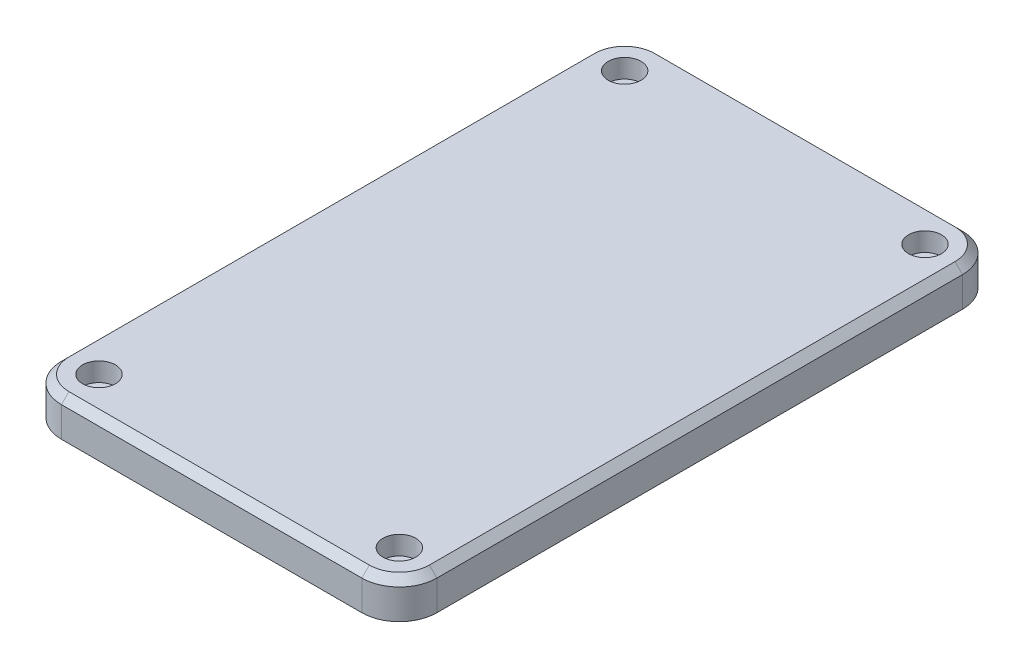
ISO-10303-21;
HEADER;
FILE_DESCRIPTION(('STEP AP214'),'2;1');
FILE_NAME('part.step','',(''),(''),'','','');
FILE_SCHEMA(('AUTOMOTIVE_DESIGN { 1 0 10303 214 1 1 1 1 }'));
ENDSEC;
DATA;
#1=APPLICATION_CONTEXT('core data for automotive mechanical design processes');
#2=APPLICATION_PROTOCOL_DEFINITION('international standard','automotive_design',2000,#1);
#3=PRODUCT_CONTEXT('',#1,'mechanical');
#4=PRODUCT('Part','Part','',(#3));
#5=PRODUCT_RELATED_PRODUCT_CATEGORY('part','',(#4));
#6=PRODUCT_DEFINITION_FORMATION('','',#4);
#7=PRODUCT_DEFINITION_CONTEXT('part definition',#1,'design');
#8=PRODUCT_DEFINITION('design','',#6,#7);
#9=PRODUCT_DEFINITION_SHAPE('','',#8);
#10=(LENGTH_UNIT() NAMED_UNIT(*) SI_UNIT(.MILLI.,.METRE.));
#11=(NAMED_UNIT(*) PLANE_ANGLE_UNIT() SI_UNIT($,.RADIAN.));
#12=(NAMED_UNIT(*) SI_UNIT($,.STERADIAN.) SOLID_ANGLE_UNIT());
#13=UNCERTAINTY_MEASURE_WITH_UNIT(LENGTH_MEASURE(1.E-05),#10,'distance_accuracy_value','');
#14=(GEOMETRIC_REPRESENTATION_CONTEXT(3) GLOBAL_UNCERTAINTY_ASSIGNED_CONTEXT((#13)) GLOBAL_UNIT_ASSIGNED_CONTEXT((#10,
#11,#12)) REPRESENTATION_CONTEXT('',''));
#15=CARTESIAN_POINT('',(0.,0.,0.));
#16=DIRECTION('',(0.,0.,1.));
#17=DIRECTION('',(1.,0.,0.));
#18=AXIS2_PLACEMENT_3D('',#15,#16,#17);
#19=CARTESIAN_POINT('',(0.,0.,203.2));
#20=DIRECTION('',(1.,0.,0.));
#21=DIRECTION('',(0.,0.,-1.));
#22=AXIS2_PLACEMENT_3D('',#19,#20,#21);
#23=PLANE('',#22);
#24=DIRECTION('',(0.,-1.,0.));
#25=VECTOR('',#24,1.);
#26=CARTESIAN_POINT('',(0.,0.,190.5));
#27=LINE('',#26,#25);
#28=CARTESIAN_POINT('',(0.,0.,190.5));
#29=VERTEX_POINT('',#28);
#30=CARTESIAN_POINT('',(0.,10.16,190.5));
#31=VERTEX_POINT('',#30);
#32=EDGE_CURVE('E125',#29,#31,#27,.F.);
#33=ORIENTED_EDGE('',*,*,#32,.T.);
#34=DIRECTION('',(0.,0.,-1.));
#35=VECTOR('',#34,1.);
#36=CARTESIAN_POINT('',(0.,10.16,203.2));
#37=LINE('',#36,#35);
#38=CARTESIAN_POINT('',(0.,10.16,12.7));
#39=VERTEX_POINT('',#38);
#40=EDGE_CURVE('E11',#31,#39,#37,.T.);
#41=ORIENTED_EDGE('',*,*,#40,.T.);
#42=DIRECTION('',(0.,-1.,0.));
#43=VECTOR('',#42,1.);
#44=CARTESIAN_POINT('',(0.,0.,12.7));
#45=LINE('',#44,#43);
#46=CARTESIAN_POINT('',(0.,0.,12.7));
#47=VERTEX_POINT('',#46);
#48=EDGE_CURVE('E123',#39,#47,#45,.T.);
#49=ORIENTED_EDGE('',*,*,#48,.T.);
#50=DIRECTION('',(0.,0.,-1.));
#51=VECTOR('',#50,1.);
#52=CARTESIAN_POINT('',(0.,0.,203.2));
#53=LINE('',#52,#51);
#54=EDGE_CURVE('E119',#29,#47,#53,.T.);
#55=ORIENTED_EDGE('',*,*,#54,.F.);
#56=EDGE_LOOP('',(#33,#41,#49,#55));
#57=FACE_BOUND('',#56,.T.);
#58=ADVANCED_FACE('F27',(#57),#23,.F.);
#59=CARTESIAN_POINT('',(0.,0.,203.2));
#60=DIRECTION('',(0.,1.,0.));
#61=DIRECTION('',(0.,0.,1.));
#62=AXIS2_PLACEMENT_3D('',#59,#60,#61);
#63=PLANE('',#62);
#64=CARTESIAN_POINT('',(12.7,0.,12.7));
#65=DIRECTION('',(0.,1.,0.));
#66=DIRECTION('',(0.,0.,1.));
#67=AXIS2_PLACEMENT_3D('',#64,#65,#66);
#68=CIRCLE('',#67,3.3782);
#69=CARTESIAN_POINT('',(12.7,0.,16.0782));
#70=VERTEX_POINT('',#69);
#71=EDGE_CURVE('E292',#70,#70,#68,.T.);
#72=ORIENTED_EDGE('',*,*,#71,.T.);
#73=EDGE_LOOP('',(#72));
#74=FACE_BOUND('',#73,.T.);
#75=CARTESIAN_POINT('',(114.3,0.,12.7));
#76=DIRECTION('',(0.,1.,0.));
#77=DIRECTION('',(0.,0.,1.));
#78=AXIS2_PLACEMENT_3D('',#75,#76,#77);
#79=CIRCLE('',#78,3.3782);
#80=CARTESIAN_POINT('',(114.3,0.,16.0782));
#81=VERTEX_POINT('',#80);
#82=EDGE_CURVE('E296',#81,#81,#79,.T.);
#83=ORIENTED_EDGE('',*,*,#82,.T.);
#84=EDGE_LOOP('',(#83));
#85=FACE_BOUND('',#84,.T.);
#86=CARTESIAN_POINT('',(114.3,0.,190.5));
#87=DIRECTION('',(0.,1.,0.));
#88=DIRECTION('',(0.,0.,1.));
#89=AXIS2_PLACEMENT_3D('',#86,#87,#88);
#90=CIRCLE('',#89,3.3782);
#91=CARTESIAN_POINT('',(114.3,0.,193.8782));
#92=VERTEX_POINT('',#91);
#93=EDGE_CURVE('E300',#92,#92,#90,.T.);
#94=ORIENTED_EDGE('',*,*,#93,.T.);
#95=EDGE_LOOP('',(#94));
#96=FACE_BOUND('',#95,.T.);
#97=CARTESIAN_POINT('',(12.7,0.,190.5));
#98=DIRECTION('',(0.,1.,0.));
#99=DIRECTION('',(0.,0.,1.));
#100=AXIS2_PLACEMENT_3D('',#97,#98,#99);
#101=CIRCLE('',#100,3.3782);
#102=CARTESIAN_POINT('',(12.7,0.,193.8782));
#103=VERTEX_POINT('',#102);
#104=EDGE_CURVE('E303',#103,#103,#101,.T.);
#105=ORIENTED_EDGE('',*,*,#104,.T.);
#106=EDGE_LOOP('',(#105));
#107=FACE_BOUND('',#106,.T.);
#108=ORIENTED_EDGE('',*,*,#54,.T.);
#109=CARTESIAN_POINT('',(12.7,0.,12.7));
#110=DIRECTION('',(0.,1.,0.));
#111=DIRECTION('',(0.,0.,1.));
#112=AXIS2_PLACEMENT_3D('',#109,#110,#111);
#113=CIRCLE('',#112,12.7);
#114=CARTESIAN_POINT('',(12.7,0.,0.));
#115=VERTEX_POINT('',#114);
#116=EDGE_CURVE('E137',#47,#115,#113,.F.);
#117=ORIENTED_EDGE('',*,*,#116,.T.);
#118=DIRECTION('',(1.,0.,0.));
#119=VECTOR('',#118,1.);
#120=CARTESIAN_POINT('',(0.,0.,0.));
#121=LINE('',#120,#119);
#122=CARTESIAN_POINT('',(114.3,0.,0.));
#123=VERTEX_POINT('',#122);
#124=EDGE_CURVE('E196',#115,#123,#121,.T.);
#125=ORIENTED_EDGE('',*,*,#124,.T.);
#126=CARTESIAN_POINT('',(114.3,0.,12.7));
#127=DIRECTION('',(0.,1.,0.));
#128=DIRECTION('',(0.,0.,1.));
#129=AXIS2_PLACEMENT_3D('',#126,#127,#128);
#130=CIRCLE('',#129,12.7);
#131=CARTESIAN_POINT('',(127.,0.,12.7));
#132=VERTEX_POINT('',#131);
#133=EDGE_CURVE('E135',#123,#132,#130,.F.);
#134=ORIENTED_EDGE('',*,*,#133,.T.);
#135=DIRECTION('',(0.,0.,-1.));
#136=VECTOR('',#135,1.);
#137=CARTESIAN_POINT('',(127.,0.,203.2));
#138=LINE('',#137,#136);
#139=CARTESIAN_POINT('',(127.,0.,190.5));
#140=VERTEX_POINT('',#139);
#141=EDGE_CURVE('E127',#140,#132,#138,.T.);
#142=ORIENTED_EDGE('',*,*,#141,.F.);
#143=CARTESIAN_POINT('',(114.3,0.,190.5));
#144=DIRECTION('',(0.,1.,0.));
#145=DIRECTION('',(0.,0.,1.));
#146=AXIS2_PLACEMENT_3D('',#143,#144,#145);
#147=CIRCLE('',#146,12.7);
#148=CARTESIAN_POINT('',(114.3,0.,203.2));
#149=VERTEX_POINT('',#148);
#150=EDGE_CURVE('E122',#140,#149,#147,.F.);
#151=ORIENTED_EDGE('',*,*,#150,.T.);
#152=DIRECTION('',(1.,0.,0.));
#153=VECTOR('',#152,1.);
#154=CARTESIAN_POINT('',(0.,0.,203.2));
#155=LINE('',#154,#153);
#156=CARTESIAN_POINT('',(12.7,0.,203.2));
#157=VERTEX_POINT('',#156);
#158=EDGE_CURVE('E121',#157,#149,#155,.T.);
#159=ORIENTED_EDGE('',*,*,#158,.F.);
#160=CARTESIAN_POINT('',(12.7,0.,190.5));
#161=DIRECTION('',(0.,1.,0.));
#162=DIRECTION('',(0.,0.,1.));
#163=AXIS2_PLACEMENT_3D('',#160,#161,#162);
#164=CIRCLE('',#163,12.7);
#165=EDGE_CURVE('E116',#157,#29,#164,.F.);
#166=ORIENTED_EDGE('',*,*,#165,.T.);
#167=EDGE_LOOP('',(#108,#117,#125,#134,#142,#151,#159,#166));
#168=FACE_BOUND('',#167,.T.);
#169=ADVANCED_FACE('F118',(#74,#85,#96,#107,#168),#63,.F.);
#170=CARTESIAN_POINT('',(127.,0.,203.2));
#171=DIRECTION('',(-1.,0.,0.));
#172=DIRECTION('',(0.,0.,1.));
#173=AXIS2_PLACEMENT_3D('',#170,#171,#172);
#174=PLANE('',#173);
#175=DIRECTION('',(0.,1.,0.));
#176=VECTOR('',#175,1.);
#177=CARTESIAN_POINT('',(127.,12.7,12.7));
#178=LINE('',#177,#176);
#179=CARTESIAN_POINT('',(127.,10.16,12.7));
#180=VERTEX_POINT('',#179);
#181=EDGE_CURVE('E146',#132,#180,#178,.T.);
#182=ORIENTED_EDGE('',*,*,#181,.T.);
#183=DIRECTION('',(0.,0.,1.));
#184=VECTOR('',#183,1.);
#185=CARTESIAN_POINT('',(127.,10.16,203.2));
#186=LINE('',#185,#184);
#187=CARTESIAN_POINT('',(127.,10.16,190.5));
#188=VERTEX_POINT('',#187);
#189=EDGE_CURVE('E171',#180,#188,#186,.T.);
#190=ORIENTED_EDGE('',*,*,#189,.T.);
#191=DIRECTION('',(0.,1.,0.));
#192=VECTOR('',#191,1.);
#193=CARTESIAN_POINT('',(127.,0.,190.5));
#194=LINE('',#193,#192);
#195=EDGE_CURVE('E144',#188,#140,#194,.F.);
#196=ORIENTED_EDGE('',*,*,#195,.T.);
#197=ORIENTED_EDGE('',*,*,#141,.T.);
#198=EDGE_LOOP('',(#182,#190,#196,#197));
#199=FACE_BOUND('',#198,.T.);
#200=ADVANCED_FACE('F225',(#199),#174,.F.);
#201=CARTESIAN_POINT('',(0.,12.7,203.2));
#202=DIRECTION('',(0.,-1.,0.));
#203=DIRECTION('',(0.,0.,-1.));
#204=AXIS2_PLACEMENT_3D('',#201,#202,#203);
#205=PLANE('',#204);
#206=CARTESIAN_POINT('',(12.7,12.7,12.7));
#207=DIRECTION('',(0.,1.,0.));
#208=DIRECTION('',(0.,0.,1.));
#209=AXIS2_PLACEMENT_3D('',#206,#207,#208);
#210=CIRCLE('',#209,5.55625);
#211=CARTESIAN_POINT('',(12.7,12.7,18.25625));
#212=VERTEX_POINT('',#211);
#213=EDGE_CURVE('E344',#212,#212,#210,.T.);
#214=ORIENTED_EDGE('',*,*,#213,.F.);
#215=EDGE_LOOP('',(#214));
#216=FACE_BOUND('',#215,.T.);
#217=CARTESIAN_POINT('',(114.3,12.7,12.7));
#218=DIRECTION('',(0.,1.,0.));
#219=DIRECTION('',(0.,0.,1.));
#220=AXIS2_PLACEMENT_3D('',#217,#218,#219);
#221=CIRCLE('',#220,5.55625);
#222=CARTESIAN_POINT('',(114.3,12.7,18.25625));
#223=VERTEX_POINT('',#222);
#224=EDGE_CURVE('E334',#223,#223,#221,.T.);
#225=ORIENTED_EDGE('',*,*,#224,.F.);
#226=EDGE_LOOP('',(#225));
#227=FACE_BOUND('',#226,.T.);
#228=CARTESIAN_POINT('',(114.3,12.7,190.5));
#229=DIRECTION('',(0.,1.,0.));
#230=DIRECTION('',(0.,0.,1.));
#231=AXIS2_PLACEMENT_3D('',#228,#229,#230);
#232=CIRCLE('',#231,5.55625);
#233=CARTESIAN_POINT('',(114.3,12.7,196.05625));
#234=VERTEX_POINT('',#233);
#235=EDGE_CURVE('E324',#234,#234,#232,.T.);
#236=ORIENTED_EDGE('',*,*,#235,.F.);
#237=EDGE_LOOP('',(#236));
#238=FACE_BOUND('',#237,.T.);
#239=CARTESIAN_POINT('',(12.7,12.7,190.5));
#240=DIRECTION('',(0.,1.,0.));
#241=DIRECTION('',(0.,0.,1.));
#242=AXIS2_PLACEMENT_3D('',#239,#240,#241);
#243=CIRCLE('',#242,5.55625);
#244=CARTESIAN_POINT('',(12.7,12.7,196.05625));
#245=VERTEX_POINT('',#244);
#246=EDGE_CURVE('E314',#245,#245,#243,.T.);
#247=ORIENTED_EDGE('',*,*,#246,.F.);
#248=EDGE_LOOP('',(#247));
#249=FACE_BOUND('',#248,.T.);
#250=CARTESIAN_POINT('',(114.3,12.7,190.5));
#251=DIRECTION('',(0.,-1.,0.));
#252=DIRECTION('',(0.,0.,-1.));
#253=AXIS2_PLACEMENT_3D('',#250,#251,#252);
#254=CIRCLE('',#253,10.16);
#255=CARTESIAN_POINT('',(114.3,12.7,200.66));
#256=VERTEX_POINT('',#255);
#257=CARTESIAN_POINT('',(124.46,12.7,190.5));
#258=VERTEX_POINT('',#257);
#259=EDGE_CURVE('E166',#256,#258,#254,.F.);
#260=ORIENTED_EDGE('',*,*,#259,.T.);
#261=DIRECTION('',(0.,0.,-1.));
#262=VECTOR('',#261,1.);
#263=CARTESIAN_POINT('',(124.46,12.7,203.2));
#264=LINE('',#263,#262);
#265=CARTESIAN_POINT('',(124.46,12.7,12.7));
#266=VERTEX_POINT('',#265);
#267=EDGE_CURVE('E168',#258,#266,#264,.T.);
#268=ORIENTED_EDGE('',*,*,#267,.T.);
#269=CARTESIAN_POINT('',(114.3,12.7,12.7));
#270=DIRECTION('',(0.,-1.,0.));
#271=DIRECTION('',(0.,0.,-1.));
#272=AXIS2_PLACEMENT_3D('',#269,#270,#271);
#273=CIRCLE('',#272,10.16);
#274=CARTESIAN_POINT('',(114.3,12.7,2.53999999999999));
#275=VERTEX_POINT('',#274);
#276=EDGE_CURVE('E164',#266,#275,#273,.F.);
#277=ORIENTED_EDGE('',*,*,#276,.T.);
#278=DIRECTION('',(-1.,0.,0.));
#279=VECTOR('',#278,1.);
#280=CARTESIAN_POINT('',(12.7,12.7,2.53999999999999));
#281=LINE('',#280,#279);
#282=CARTESIAN_POINT('',(12.7,12.7,2.53999999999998));
#283=VERTEX_POINT('',#282);
#284=EDGE_CURVE('E160',#275,#283,#281,.T.);
#285=ORIENTED_EDGE('',*,*,#284,.T.);
#286=CARTESIAN_POINT('',(12.7,12.7,12.7));
#287=DIRECTION('',(0.,-1.,0.));
#288=DIRECTION('',(0.,0.,-1.));
#289=AXIS2_PLACEMENT_3D('',#286,#287,#288);
#290=CIRCLE('',#289,10.16);
#291=CARTESIAN_POINT('',(2.53999999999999,12.7,12.7));
#292=VERTEX_POINT('',#291);
#293=EDGE_CURVE('E156',#283,#292,#290,.F.);
#294=ORIENTED_EDGE('',*,*,#293,.T.);
#295=DIRECTION('',(0.,0.,1.));
#296=VECTOR('',#295,1.);
#297=CARTESIAN_POINT('',(2.53999999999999,12.7,203.2));
#298=LINE('',#297,#296);
#299=CARTESIAN_POINT('',(2.53999999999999,12.7,190.5));
#300=VERTEX_POINT('',#299);
#301=EDGE_CURVE('E154',#292,#300,#298,.T.);
#302=ORIENTED_EDGE('',*,*,#301,.T.);
#303=CARTESIAN_POINT('',(12.7,12.7,190.5));
#304=DIRECTION('',(0.,-1.,0.));
#305=DIRECTION('',(0.,0.,-1.));
#306=AXIS2_PLACEMENT_3D('',#303,#304,#305);
#307=CIRCLE('',#306,10.16);
#308=CARTESIAN_POINT('',(12.7,12.7,200.66));
#309=VERTEX_POINT('',#308);
#310=EDGE_CURVE('E158',#300,#309,#307,.F.);
#311=ORIENTED_EDGE('',*,*,#310,.T.);
#312=DIRECTION('',(1.,0.,0.));
#313=VECTOR('',#312,1.);
#314=CARTESIAN_POINT('',(0.,12.7,200.66));
#315=LINE('',#314,#313);
#316=EDGE_CURVE('E162',#309,#256,#315,.T.);
#317=ORIENTED_EDGE('',*,*,#316,.T.);
#318=EDGE_LOOP('',(#260,#268,#277,#285,#294,#302,#311,#317));
#319=FACE_BOUND('',#318,.T.);
#320=ADVANCED_FACE('F268',(#216,#227,#238,#249,#319),#205,.F.);
#321=CARTESIAN_POINT('',(0.,12.7,203.2));
#322=DIRECTION('',(0.,0.,-1.));
#323=DIRECTION('',(-1.,0.,0.));
#324=AXIS2_PLACEMENT_3D('',#321,#322,#323);
#325=PLANE('',#324);
#326=DIRECTION('',(0.,1.,0.));
#327=VECTOR('',#326,1.);
#328=CARTESIAN_POINT('',(114.3,12.7,203.2));
#329=LINE('',#328,#327);
#330=CARTESIAN_POINT('',(114.3,10.16,203.2));
#331=VERTEX_POINT('',#330);
#332=EDGE_CURVE('E151',#149,#331,#329,.T.);
#333=ORIENTED_EDGE('',*,*,#332,.T.);
#334=DIRECTION('',(-1.,0.,0.));
#335=VECTOR('',#334,1.);
#336=CARTESIAN_POINT('',(0.,10.16,203.2));
#337=LINE('',#336,#335);
#338=CARTESIAN_POINT('',(12.7,10.16,203.2));
#339=VERTEX_POINT('',#338);
#340=EDGE_CURVE('E178',#331,#339,#337,.T.);
#341=ORIENTED_EDGE('',*,*,#340,.T.);
#342=DIRECTION('',(0.,-1.,0.));
#343=VECTOR('',#342,1.);
#344=CARTESIAN_POINT('',(12.7,12.7,203.2));
#345=LINE('',#344,#343);
#346=EDGE_CURVE('E149',#339,#157,#345,.T.);
#347=ORIENTED_EDGE('',*,*,#346,.T.);
#348=ORIENTED_EDGE('',*,*,#158,.T.);
#349=EDGE_LOOP('',(#333,#341,#347,#348));
#350=FACE_BOUND('',#349,.T.);
#351=ADVANCED_FACE('F245',(#350),#325,.F.);
#352=CARTESIAN_POINT('',(0.,12.7,0.));
#353=DIRECTION('',(0.,0.,-1.));
#354=DIRECTION('',(-1.,0.,0.));
#355=AXIS2_PLACEMENT_3D('',#352,#353,#354);
#356=PLANE('',#355);
#357=DIRECTION('',(0.,-1.,0.));
#358=VECTOR('',#357,1.);
#359=CARTESIAN_POINT('',(12.7,12.7,0.));
#360=LINE('',#359,#358);
#361=CARTESIAN_POINT('',(12.7,10.16,0.));
#362=VERTEX_POINT('',#361);
#363=EDGE_CURVE('E141',#115,#362,#360,.F.);
#364=ORIENTED_EDGE('',*,*,#363,.T.);
#365=DIRECTION('',(1.,0.,0.));
#366=VECTOR('',#365,1.);
#367=CARTESIAN_POINT('',(114.3,10.16,0.));
#368=LINE('',#367,#366);
#369=CARTESIAN_POINT('',(114.3,10.16,0.));
#370=VERTEX_POINT('',#369);
#371=EDGE_CURVE('E180',#362,#370,#368,.T.);
#372=ORIENTED_EDGE('',*,*,#371,.T.);
#373=DIRECTION('',(0.,1.,0.));
#374=VECTOR('',#373,1.);
#375=CARTESIAN_POINT('',(114.3,0.,0.));
#376=LINE('',#375,#374);
#377=EDGE_CURVE('E139',#370,#123,#376,.F.);
#378=ORIENTED_EDGE('',*,*,#377,.T.);
#379=ORIENTED_EDGE('',*,*,#124,.F.);
#380=EDGE_LOOP('',(#364,#372,#378,#379));
#381=FACE_BOUND('',#380,.T.);
#382=ADVANCED_FACE('F192',(#381),#356,.T.);
#383=CARTESIAN_POINT('',(12.7,0.,12.7));
#384=DIRECTION('',(0.,1.,0.));
#385=DIRECTION('',(0.,0.,1.));
#386=AXIS2_PLACEMENT_3D('',#383,#384,#385);
#387=CYLINDRICAL_SURFACE('',#386,12.7);
#388=ORIENTED_EDGE('',*,*,#48,.F.);
#389=CARTESIAN_POINT('',(12.7,10.16,12.7));
#390=DIRECTION('',(0.,-1.,0.));
#391=DIRECTION('',(0.,0.,-1.));
#392=AXIS2_PLACEMENT_3D('',#389,#390,#391);
#393=CIRCLE('',#392,12.7);
#394=EDGE_CURVE('E34',#39,#362,#393,.T.);
#395=ORIENTED_EDGE('',*,*,#394,.T.);
#396=ORIENTED_EDGE('',*,*,#363,.F.);
#397=ORIENTED_EDGE('',*,*,#116,.F.);
#398=EDGE_LOOP('',(#388,#395,#396,#397));
#399=FACE_BOUND('',#398,.T.);
#400=ADVANCED_FACE('F185',(#399),#387,.T.);
#401=CARTESIAN_POINT('',(114.3,0.,12.7));
#402=DIRECTION('',(0.,-1.,0.));
#403=DIRECTION('',(0.,0.,-1.));
#404=AXIS2_PLACEMENT_3D('',#401,#402,#403);
#405=CYLINDRICAL_SURFACE('',#404,12.7);
#406=ORIENTED_EDGE('',*,*,#377,.F.);
#407=CARTESIAN_POINT('',(114.3,10.16,12.7));
#408=DIRECTION('',(0.,-1.,0.));
#409=DIRECTION('',(0.,0.,-1.));
#410=AXIS2_PLACEMENT_3D('',#407,#408,#409);
#411=CIRCLE('',#410,12.7);
#412=EDGE_CURVE('E176',#370,#180,#411,.T.);
#413=ORIENTED_EDGE('',*,*,#412,.T.);
#414=ORIENTED_EDGE('',*,*,#181,.F.);
#415=ORIENTED_EDGE('',*,*,#133,.F.);
#416=EDGE_LOOP('',(#406,#413,#414,#415));
#417=FACE_BOUND('',#416,.T.);
#418=ADVANCED_FACE('F220',(#417),#405,.T.);
#419=CARTESIAN_POINT('',(114.3,12.7,190.5));
#420=DIRECTION('',(0.,1.,0.));
#421=DIRECTION('',(0.,0.,1.));
#422=AXIS2_PLACEMENT_3D('',#419,#420,#421);
#423=CYLINDRICAL_SURFACE('',#422,12.7);
#424=ORIENTED_EDGE('',*,*,#195,.F.);
#425=CARTESIAN_POINT('',(114.3,10.16,190.5));
#426=DIRECTION('',(0.,-1.,0.));
#427=DIRECTION('',(0.,0.,-1.));
#428=AXIS2_PLACEMENT_3D('',#425,#426,#427);
#429=CIRCLE('',#428,12.7);
#430=EDGE_CURVE('E174',#188,#331,#429,.T.);
#431=ORIENTED_EDGE('',*,*,#430,.T.);
#432=ORIENTED_EDGE('',*,*,#332,.F.);
#433=ORIENTED_EDGE('',*,*,#150,.F.);
#434=EDGE_LOOP('',(#424,#431,#432,#433));
#435=FACE_BOUND('',#434,.T.);
#436=ADVANCED_FACE('F241',(#435),#423,.T.);
#437=CARTESIAN_POINT('',(12.7,12.7,190.5));
#438=DIRECTION('',(0.,-1.,0.));
#439=DIRECTION('',(0.,0.,-1.));
#440=AXIS2_PLACEMENT_3D('',#437,#438,#439);
#441=CYLINDRICAL_SURFACE('',#440,12.7);
#442=ORIENTED_EDGE('',*,*,#346,.F.);
#443=CARTESIAN_POINT('',(12.7,10.16,190.5));
#444=DIRECTION('',(0.,-1.,0.));
#445=DIRECTION('',(0.,0.,-1.));
#446=AXIS2_PLACEMENT_3D('',#443,#444,#445);
#447=CIRCLE('',#446,12.7);
#448=EDGE_CURVE('E47',#339,#31,#447,.T.);
#449=ORIENTED_EDGE('',*,*,#448,.T.);
#450=ORIENTED_EDGE('',*,*,#32,.F.);
#451=ORIENTED_EDGE('',*,*,#165,.F.);
#452=EDGE_LOOP('',(#442,#449,#450,#451));
#453=FACE_BOUND('',#452,.T.);
#454=ADVANCED_FACE('F129',(#453),#441,.T.);
#455=CARTESIAN_POINT('',(0.,10.16,203.2));
#456=DIRECTION('',(0.707106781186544,-0.707106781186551,0.));
#457=DIRECTION('',(0.707106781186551,0.707106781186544,0.));
#458=AXIS2_PLACEMENT_3D('',#455,#456,#457);
#459=PLANE('',#458);
#460=DIRECTION('',(0.707106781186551,0.707106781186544,0.));
#461=VECTOR('',#460,1.);
#462=CARTESIAN_POINT('',(0.,10.16,12.7));
#463=LINE('',#462,#461);
#464=EDGE_CURVE('E253',#39,#292,#463,.T.);
#465=ORIENTED_EDGE('',*,*,#464,.F.);
#466=ORIENTED_EDGE('',*,*,#40,.F.);
#467=DIRECTION('',(-0.707106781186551,-0.707106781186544,0.));
#468=VECTOR('',#467,1.);
#469=CARTESIAN_POINT('',(2.53999999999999,12.7,190.5));
#470=LINE('',#469,#468);
#471=EDGE_CURVE('E255',#300,#31,#470,.T.);
#472=ORIENTED_EDGE('',*,*,#471,.F.);
#473=ORIENTED_EDGE('',*,*,#301,.F.);
#474=EDGE_LOOP('',(#465,#466,#472,#473));
#475=FACE_BOUND('',#474,.T.);
#476=ADVANCED_FACE('F266',(#475),#459,.F.);
#477=CARTESIAN_POINT('',(12.7,12.7,190.5));
#478=DIRECTION('',(0.,-1.,0.));
#479=DIRECTION('',(0.,0.,-1.));
#480=AXIS2_PLACEMENT_3D('',#477,#478,#479);
#481=CONICAL_SURFACE('',#480,10.16,0.785398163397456);
#482=ORIENTED_EDGE('',*,*,#471,.T.);
#483=ORIENTED_EDGE('',*,*,#448,.F.);
#484=DIRECTION('',(0.,-0.707106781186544,0.707106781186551));
#485=VECTOR('',#484,1.);
#486=CARTESIAN_POINT('',(12.7,12.7,200.66));
#487=LINE('',#486,#485);
#488=EDGE_CURVE('E203',#309,#339,#487,.T.);
#489=ORIENTED_EDGE('',*,*,#488,.F.);
#490=ORIENTED_EDGE('',*,*,#310,.F.);
#491=EDGE_LOOP('',(#482,#483,#489,#490));
#492=FACE_BOUND('',#491,.T.);
#493=ADVANCED_FACE('F263',(#492),#481,.T.);
#494=CARTESIAN_POINT('',(12.7,12.7,12.7));
#495=DIRECTION('',(0.,-1.,0.));
#496=DIRECTION('',(0.,0.,-1.));
#497=AXIS2_PLACEMENT_3D('',#494,#495,#496);
#498=CONICAL_SURFACE('',#497,10.16,0.785398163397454);
#499=ORIENTED_EDGE('',*,*,#464,.T.);
#500=ORIENTED_EDGE('',*,*,#293,.F.);
#501=DIRECTION('',(0.,0.707106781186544,0.707106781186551));
#502=VECTOR('',#501,1.);
#503=CARTESIAN_POINT('',(12.7,10.16,0.));
#504=LINE('',#503,#502);
#505=EDGE_CURVE('E199',#362,#283,#504,.T.);
#506=ORIENTED_EDGE('',*,*,#505,.F.);
#507=ORIENTED_EDGE('',*,*,#394,.F.);
#508=EDGE_LOOP('',(#499,#500,#506,#507));
#509=FACE_BOUND('',#508,.T.);
#510=ADVANCED_FACE('F200',(#509),#498,.T.);
#511=CARTESIAN_POINT('',(0.,10.16,203.2));
#512=DIRECTION('',(0.,-0.707106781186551,-0.707106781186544));
#513=DIRECTION('',(0.,0.707106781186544,-0.707106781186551));
#514=AXIS2_PLACEMENT_3D('',#511,#512,#513);
#515=PLANE('',#514);
#516=ORIENTED_EDGE('',*,*,#488,.T.);
#517=ORIENTED_EDGE('',*,*,#340,.F.);
#518=DIRECTION('',(0.,-0.707106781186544,0.707106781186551));
#519=VECTOR('',#518,1.);
#520=CARTESIAN_POINT('',(114.3,12.7,200.66));
#521=LINE('',#520,#519);
#522=EDGE_CURVE('E204',#256,#331,#521,.T.);
#523=ORIENTED_EDGE('',*,*,#522,.F.);
#524=ORIENTED_EDGE('',*,*,#316,.F.);
#525=EDGE_LOOP('',(#516,#517,#523,#524));
#526=FACE_BOUND('',#525,.T.);
#527=ADVANCED_FACE('F248',(#526),#515,.F.);
#528=CARTESIAN_POINT('',(0.,12.7,2.53999999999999));
#529=DIRECTION('',(0.,0.707106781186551,-0.707106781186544));
#530=DIRECTION('',(0.,0.707106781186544,0.707106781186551));
#531=AXIS2_PLACEMENT_3D('',#528,#529,#530);
#532=PLANE('',#531);
#533=ORIENTED_EDGE('',*,*,#505,.T.);
#534=ORIENTED_EDGE('',*,*,#284,.F.);
#535=DIRECTION('',(0.,0.707106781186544,0.707106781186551));
#536=VECTOR('',#535,1.);
#537=CARTESIAN_POINT('',(114.3,10.16,0.));
#538=LINE('',#537,#536);
#539=EDGE_CURVE('E209',#370,#275,#538,.T.);
#540=ORIENTED_EDGE('',*,*,#539,.F.);
#541=ORIENTED_EDGE('',*,*,#371,.F.);
#542=EDGE_LOOP('',(#533,#534,#540,#541));
#543=FACE_BOUND('',#542,.T.);
#544=ADVANCED_FACE('F207',(#543),#532,.T.);
#545=CARTESIAN_POINT('',(114.3,12.7,190.5));
#546=DIRECTION('',(0.,-1.,0.));
#547=DIRECTION('',(0.,0.,-1.));
#548=AXIS2_PLACEMENT_3D('',#545,#546,#547);
#549=CONICAL_SURFACE('',#548,10.16,0.785398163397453);
#550=ORIENTED_EDGE('',*,*,#522,.T.);
#551=ORIENTED_EDGE('',*,*,#430,.F.);
#552=DIRECTION('',(0.707106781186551,-0.707106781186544,0.));
#553=VECTOR('',#552,1.);
#554=CARTESIAN_POINT('',(124.46,12.7,190.5));
#555=LINE('',#554,#553);
#556=EDGE_CURVE('E213',#258,#188,#555,.T.);
#557=ORIENTED_EDGE('',*,*,#556,.F.);
#558=ORIENTED_EDGE('',*,*,#259,.F.);
#559=EDGE_LOOP('',(#550,#551,#557,#558));
#560=FACE_BOUND('',#559,.T.);
#561=ADVANCED_FACE('F237',(#560),#549,.T.);
#562=CARTESIAN_POINT('',(114.3,12.7,12.7));
#563=DIRECTION('',(0.,-1.,0.));
#564=DIRECTION('',(0.,0.,-1.));
#565=AXIS2_PLACEMENT_3D('',#562,#563,#564);
#566=CONICAL_SURFACE('',#565,10.16,0.785398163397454);
#567=ORIENTED_EDGE('',*,*,#539,.T.);
#568=ORIENTED_EDGE('',*,*,#276,.F.);
#569=DIRECTION('',(-0.707106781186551,0.707106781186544,0.));
#570=VECTOR('',#569,1.);
#571=CARTESIAN_POINT('',(127.,10.16,12.7));
#572=LINE('',#571,#570);
#573=EDGE_CURVE('E217',#180,#266,#572,.T.);
#574=ORIENTED_EDGE('',*,*,#573,.F.);
#575=ORIENTED_EDGE('',*,*,#412,.F.);
#576=EDGE_LOOP('',(#567,#568,#574,#575));
#577=FACE_BOUND('',#576,.T.);
#578=ADVANCED_FACE('F216',(#577),#566,.T.);
#579=CARTESIAN_POINT('',(124.46,12.7,203.2));
#580=DIRECTION('',(-0.707106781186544,-0.707106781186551,0.));
#581=DIRECTION('',(0.707106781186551,-0.707106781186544,0.));
#582=AXIS2_PLACEMENT_3D('',#579,#580,#581);
#583=PLANE('',#582);
#584=ORIENTED_EDGE('',*,*,#556,.T.);
#585=ORIENTED_EDGE('',*,*,#189,.F.);
#586=ORIENTED_EDGE('',*,*,#573,.T.);
#587=ORIENTED_EDGE('',*,*,#267,.F.);
#588=EDGE_LOOP('',(#584,#585,#586,#587));
#589=FACE_BOUND('',#588,.T.);
#590=ADVANCED_FACE('F229',(#589),#583,.F.);
#591=CARTESIAN_POINT('',(12.7,12.7,190.5));
#592=DIRECTION('',(0.,1.,0.));
#593=DIRECTION('',(0.,0.,1.));
#594=AXIS2_PLACEMENT_3D('',#591,#592,#593);
#595=CYLINDRICAL_SURFACE('',#594,3.3782);
#596=ORIENTED_EDGE('',*,*,#104,.F.);
#597=EDGE_LOOP('',(#596));
#598=FACE_BOUND('',#597,.T.);
#599=CARTESIAN_POINT('',(12.7,6.35,190.5));
#600=DIRECTION('',(0.,1.,0.));
#601=DIRECTION('',(0.,0.,1.));
#602=AXIS2_PLACEMENT_3D('',#599,#600,#601);
#603=CIRCLE('',#602,3.3782);
#604=CARTESIAN_POINT('',(12.7,6.35,193.8782));
#605=VERTEX_POINT('',#604);
#606=EDGE_CURVE('E305',#605,#605,#603,.T.);
#607=ORIENTED_EDGE('',*,*,#606,.T.);
#608=EDGE_LOOP('',(#607));
#609=FACE_BOUND('',#608,.T.);
#610=ADVANCED_FACE('F394',(#598,#609),#595,.F.);
#611=CARTESIAN_POINT('',(16.0782,6.35,190.5));
#612=DIRECTION('',(0.,-1.,0.));
#613=DIRECTION('',(0.,0.,-1.));
#614=AXIS2_PLACEMENT_3D('',#611,#612,#613);
#615=PLANE('',#614);
#616=ORIENTED_EDGE('',*,*,#606,.F.);
#617=EDGE_LOOP('',(#616));
#618=FACE_BOUND('',#617,.T.);
#619=CARTESIAN_POINT('',(12.7,6.35,190.5));
#620=DIRECTION('',(0.,1.,0.));
#621=DIRECTION('',(0.,0.,1.));
#622=AXIS2_PLACEMENT_3D('',#619,#620,#621);
#623=CIRCLE('',#622,5.55625);
#624=CARTESIAN_POINT('',(12.7,6.35,196.05625));
#625=VERTEX_POINT('',#624);
#626=EDGE_CURVE('E309',#625,#625,#623,.T.);
#627=ORIENTED_EDGE('',*,*,#626,.T.);
#628=EDGE_LOOP('',(#627));
#629=FACE_BOUND('',#628,.T.);
#630=ADVANCED_FACE('F390',(#618,#629),#615,.F.);
#631=CARTESIAN_POINT('',(12.7,12.7,190.5));
#632=DIRECTION('',(0.,1.,0.));
#633=DIRECTION('',(0.,0.,1.));
#634=AXIS2_PLACEMENT_3D('',#631,#632,#633);
#635=CYLINDRICAL_SURFACE('',#634,5.55625);
#636=ORIENTED_EDGE('',*,*,#626,.F.);
#637=EDGE_LOOP('',(#636));
#638=FACE_BOUND('',#637,.T.);
#639=ORIENTED_EDGE('',*,*,#246,.T.);
#640=EDGE_LOOP('',(#639));
#641=FACE_BOUND('',#640,.T.);
#642=ADVANCED_FACE('F386',(#638,#641),#635,.F.);
#643=CARTESIAN_POINT('',(114.3,12.7,190.5));
#644=DIRECTION('',(0.,1.,0.));
#645=DIRECTION('',(0.,0.,1.));
#646=AXIS2_PLACEMENT_3D('',#643,#644,#645);
#647=CYLINDRICAL_SURFACE('',#646,3.3782);
#648=ORIENTED_EDGE('',*,*,#93,.F.);
#649=EDGE_LOOP('',(#648));
#650=FACE_BOUND('',#649,.T.);
#651=CARTESIAN_POINT('',(114.3,6.35,190.5));
#652=DIRECTION('',(0.,1.,0.));
#653=DIRECTION('',(0.,0.,1.));
#654=AXIS2_PLACEMENT_3D('',#651,#652,#653);
#655=CIRCLE('',#654,3.3782);
#656=CARTESIAN_POINT('',(114.3,6.35,193.8782));
#657=VERTEX_POINT('',#656);
#658=EDGE_CURVE('E318',#657,#657,#655,.T.);
#659=ORIENTED_EDGE('',*,*,#658,.T.);
#660=EDGE_LOOP('',(#659));
#661=FACE_BOUND('',#660,.T.);
#662=ADVANCED_FACE('F382',(#650,#661),#647,.F.);
#663=CARTESIAN_POINT('',(117.6782,6.35,190.5));
#664=DIRECTION('',(0.,-1.,0.));
#665=DIRECTION('',(0.,0.,-1.));
#666=AXIS2_PLACEMENT_3D('',#663,#664,#665);
#667=PLANE('',#666);
#668=ORIENTED_EDGE('',*,*,#658,.F.);
#669=EDGE_LOOP('',(#668));
#670=FACE_BOUND('',#669,.T.);
#671=CARTESIAN_POINT('',(114.3,6.35,190.5));
#672=DIRECTION('',(0.,1.,0.));
#673=DIRECTION('',(0.,0.,1.));
#674=AXIS2_PLACEMENT_3D('',#671,#672,#673);
#675=CIRCLE('',#674,5.55625);
#676=CARTESIAN_POINT('',(114.3,6.35,196.05625));
#677=VERTEX_POINT('',#676);
#678=EDGE_CURVE('E321',#677,#677,#675,.T.);
#679=ORIENTED_EDGE('',*,*,#678,.T.);
#680=EDGE_LOOP('',(#679));
#681=FACE_BOUND('',#680,.T.);
#682=ADVANCED_FACE('F378',(#670,#681),#667,.F.);
#683=CARTESIAN_POINT('',(114.3,12.7,190.5));
#684=DIRECTION('',(0.,1.,0.));
#685=DIRECTION('',(0.,0.,1.));
#686=AXIS2_PLACEMENT_3D('',#683,#684,#685);
#687=CYLINDRICAL_SURFACE('',#686,5.55625);
#688=ORIENTED_EDGE('',*,*,#678,.F.);
#689=EDGE_LOOP('',(#688));
#690=FACE_BOUND('',#689,.T.);
#691=ORIENTED_EDGE('',*,*,#235,.T.);
#692=EDGE_LOOP('',(#691));
#693=FACE_BOUND('',#692,.T.);
#694=ADVANCED_FACE('F374',(#690,#693),#687,.F.);
#695=CARTESIAN_POINT('',(114.3,12.7,12.7));
#696=DIRECTION('',(0.,1.,0.));
#697=DIRECTION('',(0.,0.,1.));
#698=AXIS2_PLACEMENT_3D('',#695,#696,#697);
#699=CYLINDRICAL_SURFACE('',#698,3.3782);
#700=ORIENTED_EDGE('',*,*,#82,.F.);
#701=EDGE_LOOP('',(#700));
#702=FACE_BOUND('',#701,.T.);
#703=CARTESIAN_POINT('',(114.3,6.35,12.7));
#704=DIRECTION('',(0.,1.,0.));
#705=DIRECTION('',(0.,0.,1.));
#706=AXIS2_PLACEMENT_3D('',#703,#704,#705);
#707=CIRCLE('',#706,3.3782);
#708=CARTESIAN_POINT('',(114.3,6.35,16.0782));
#709=VERTEX_POINT('',#708);
#710=EDGE_CURVE('E328',#709,#709,#707,.T.);
#711=ORIENTED_EDGE('',*,*,#710,.T.);
#712=EDGE_LOOP('',(#711));
#713=FACE_BOUND('',#712,.T.);
#714=ADVANCED_FACE('F370',(#702,#713),#699,.F.);
#715=CARTESIAN_POINT('',(117.6782,6.35,12.7));
#716=DIRECTION('',(0.,-1.,0.));
#717=DIRECTION('',(0.,0.,-1.));
#718=AXIS2_PLACEMENT_3D('',#715,#716,#717);
#719=PLANE('',#718);
#720=ORIENTED_EDGE('',*,*,#710,.F.);
#721=EDGE_LOOP('',(#720));
#722=FACE_BOUND('',#721,.T.);
#723=CARTESIAN_POINT('',(114.3,6.35,12.7));
#724=DIRECTION('',(0.,1.,0.));
#725=DIRECTION('',(0.,0.,1.));
#726=AXIS2_PLACEMENT_3D('',#723,#724,#725);
#727=CIRCLE('',#726,5.55625);
#728=CARTESIAN_POINT('',(114.3,6.35,18.25625));
#729=VERTEX_POINT('',#728);
#730=EDGE_CURVE('E331',#729,#729,#727,.T.);
#731=ORIENTED_EDGE('',*,*,#730,.T.);
#732=EDGE_LOOP('',(#731));
#733=FACE_BOUND('',#732,.T.);
#734=ADVANCED_FACE('F366',(#722,#733),#719,.F.);
#735=CARTESIAN_POINT('',(114.3,12.7,12.7));
#736=DIRECTION('',(0.,1.,0.));
#737=DIRECTION('',(0.,0.,1.));
#738=AXIS2_PLACEMENT_3D('',#735,#736,#737);
#739=CYLINDRICAL_SURFACE('',#738,5.55625);
#740=ORIENTED_EDGE('',*,*,#730,.F.);
#741=EDGE_LOOP('',(#740));
#742=FACE_BOUND('',#741,.T.);
#743=ORIENTED_EDGE('',*,*,#224,.T.);
#744=EDGE_LOOP('',(#743));
#745=FACE_BOUND('',#744,.T.);
#746=ADVANCED_FACE('F362',(#742,#745),#739,.F.);
#747=CARTESIAN_POINT('',(12.7,12.7,12.7));
#748=DIRECTION('',(0.,1.,0.));
#749=DIRECTION('',(0.,0.,1.));
#750=AXIS2_PLACEMENT_3D('',#747,#748,#749);
#751=CYLINDRICAL_SURFACE('',#750,3.3782);
#752=ORIENTED_EDGE('',*,*,#71,.F.);
#753=EDGE_LOOP('',(#752));
#754=FACE_BOUND('',#753,.T.);
#755=CARTESIAN_POINT('',(12.7,6.35,12.7));
#756=DIRECTION('',(0.,1.,0.));
#757=DIRECTION('',(0.,0.,1.));
#758=AXIS2_PLACEMENT_3D('',#755,#756,#757);
#759=CIRCLE('',#758,3.3782);
#760=CARTESIAN_POINT('',(12.7,6.35,16.0782));
#761=VERTEX_POINT('',#760);
#762=EDGE_CURVE('E338',#761,#761,#759,.T.);
#763=ORIENTED_EDGE('',*,*,#762,.T.);
#764=EDGE_LOOP('',(#763));
#765=FACE_BOUND('',#764,.T.);
#766=ADVANCED_FACE('F355',(#754,#765),#751,.F.);
#767=CARTESIAN_POINT('',(16.0782,6.35,12.7));
#768=DIRECTION('',(0.,-1.,0.));
#769=DIRECTION('',(0.,0.,-1.));
#770=AXIS2_PLACEMENT_3D('',#767,#768,#769);
#771=PLANE('',#770);
#772=ORIENTED_EDGE('',*,*,#762,.F.);
#773=EDGE_LOOP('',(#772));
#774=FACE_BOUND('',#773,.T.);
#775=CARTESIAN_POINT('',(12.7,6.35,12.7));
#776=DIRECTION('',(0.,1.,0.));
#777=DIRECTION('',(0.,0.,1.));
#778=AXIS2_PLACEMENT_3D('',#775,#776,#777);
#779=CIRCLE('',#778,5.55625);
#780=CARTESIAN_POINT('',(12.7,6.35,18.25625));
#781=VERTEX_POINT('',#780);
#782=EDGE_CURVE('E341',#781,#781,#779,.T.);
#783=ORIENTED_EDGE('',*,*,#782,.T.);
#784=EDGE_LOOP('',(#783));
#785=FACE_BOUND('',#784,.T.);
#786=ADVANCED_FACE('F349',(#774,#785),#771,.F.);
#787=CARTESIAN_POINT('',(12.7,12.7,12.7));
#788=DIRECTION('',(0.,1.,0.));
#789=DIRECTION('',(0.,0.,1.));
#790=AXIS2_PLACEMENT_3D('',#787,#788,#789);
#791=CYLINDRICAL_SURFACE('',#790,5.55625);
#792=ORIENTED_EDGE('',*,*,#782,.F.);
#793=EDGE_LOOP('',(#792));
#794=FACE_BOUND('',#793,.T.);
#795=ORIENTED_EDGE('',*,*,#213,.T.);
#796=EDGE_LOOP('',(#795));
#797=FACE_BOUND('',#796,.T.);
#798=ADVANCED_FACE('F347',(#794,#797),#791,.F.);
#799=CLOSED_SHELL('',(#58,#169,#200,#320,#351,#382,#400,#418,#436,#454,#476,#493,#510,#527,#544,
#561,#578,#590,#610,#630,#642,#662,#682,#694,#714,#734,#746,#766,#786,#798));
#800=MANIFOLD_SOLID_BREP('B2',#799);
#801=ADVANCED_BREP_SHAPE_REPRESENTATION('',(#18,#800),#14);
#802=SHAPE_DEFINITION_REPRESENTATION(#9,#801);
ENDSEC;
END-ISO-10303-21;
